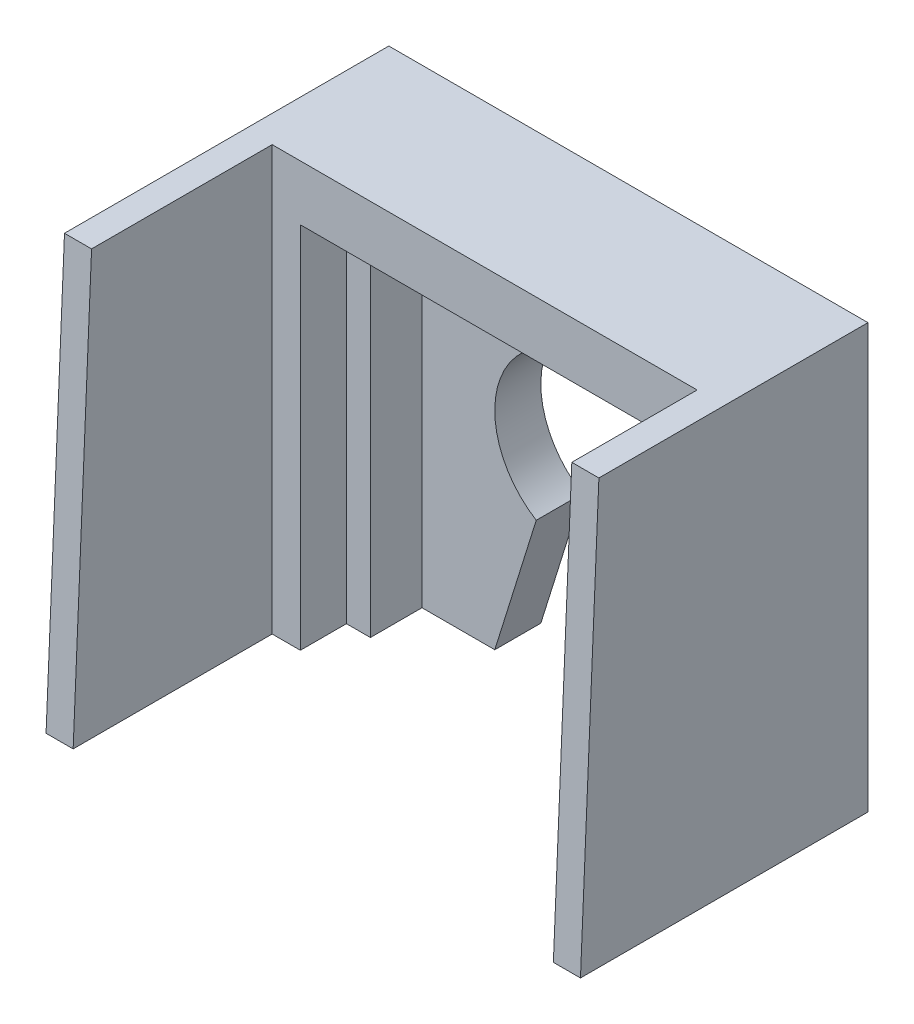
ISO-10303-21;
HEADER;
FILE_DESCRIPTION(('STEP AP214'),'2;1');
FILE_NAME('part.step','',(''),(''),'','','');
FILE_SCHEMA(('AUTOMOTIVE_DESIGN { 1 0 10303 214 1 1 1 1 }'));
ENDSEC;
DATA;
#1=APPLICATION_CONTEXT('core data for automotive mechanical design processes');
#2=APPLICATION_PROTOCOL_DEFINITION('international standard','automotive_design',2000,#1);
#3=PRODUCT_CONTEXT('',#1,'mechanical');
#4=PRODUCT('Part','Part','',(#3));
#5=PRODUCT_RELATED_PRODUCT_CATEGORY('part','',(#4));
#6=PRODUCT_DEFINITION_FORMATION('','',#4);
#7=PRODUCT_DEFINITION_CONTEXT('part definition',#1,'design');
#8=PRODUCT_DEFINITION('design','',#6,#7);
#9=PRODUCT_DEFINITION_SHAPE('','',#8);
#10=(LENGTH_UNIT() NAMED_UNIT(*) SI_UNIT(.MILLI.,.METRE.));
#11=(NAMED_UNIT(*) PLANE_ANGLE_UNIT() SI_UNIT($,.RADIAN.));
#12=(NAMED_UNIT(*) SI_UNIT($,.STERADIAN.) SOLID_ANGLE_UNIT());
#13=UNCERTAINTY_MEASURE_WITH_UNIT(LENGTH_MEASURE(1.E-05),#10,'distance_accuracy_value','');
#14=(GEOMETRIC_REPRESENTATION_CONTEXT(3) GLOBAL_UNCERTAINTY_ASSIGNED_CONTEXT((#13)) GLOBAL_UNIT_ASSIGNED_CONTEXT((#10,
#11,#12)) REPRESENTATION_CONTEXT('',''));
#15=CARTESIAN_POINT('',(0.,0.,0.));
#16=DIRECTION('',(0.,0.,1.));
#17=DIRECTION('',(1.,0.,0.));
#18=AXIS2_PLACEMENT_3D('',#15,#16,#17);
#19=CARTESIAN_POINT('',(13.,-11.25,7.8));
#20=DIRECTION('',(0.,0.,1.));
#21=DIRECTION('',(1.,0.,0.));
#22=AXIS2_PLACEMENT_3D('',#19,#20,#21);
#23=PLANE('',#22);
#24=DIRECTION('',(1.,0.,0.));
#25=VECTOR('',#24,1.);
#26=CARTESIAN_POINT('',(13.,-11.25,7.8));
#27=LINE('',#26,#25);
#28=CARTESIAN_POINT('',(10.,-11.25,7.8));
#29=VERTEX_POINT('',#28);
#30=CARTESIAN_POINT('',(11.53,-11.25,7.8));
#31=VERTEX_POINT('',#30);
#32=EDGE_CURVE('E303',#29,#31,#27,.T.);
#33=ORIENTED_EDGE('',*,*,#32,.T.);
#34=DIRECTION('',(0.,-1.,0.));
#35=VECTOR('',#34,1.);
#36=CARTESIAN_POINT('',(11.53,11.75,7.8));
#37=LINE('',#36,#35);
#38=CARTESIAN_POINT('',(11.53,11.75,7.8));
#39=VERTEX_POINT('',#38);
#40=EDGE_CURVE('E363',#39,#31,#37,.T.);
#41=ORIENTED_EDGE('',*,*,#40,.F.);
#42=DIRECTION('',(-1.,0.,0.));
#43=VECTOR('',#42,1.);
#44=CARTESIAN_POINT('',(-13.,11.75,7.8));
#45=LINE('',#44,#43);
#46=CARTESIAN_POINT('',(-11.53,11.75,7.8));
#47=VERTEX_POINT('',#46);
#48=EDGE_CURVE('E241',#39,#47,#45,.T.);
#49=ORIENTED_EDGE('',*,*,#48,.T.);
#50=DIRECTION('',(0.,1.,0.));
#51=VECTOR('',#50,1.);
#52=CARTESIAN_POINT('',(-11.53,11.75,7.8));
#53=LINE('',#52,#51);
#54=CARTESIAN_POINT('',(-11.53,-11.25,7.8));
#55=VERTEX_POINT('',#54);
#56=EDGE_CURVE('E242',#55,#47,#53,.T.);
#57=ORIENTED_EDGE('',*,*,#56,.F.);
#58=DIRECTION('',(1.,0.,0.));
#59=VECTOR('',#58,1.);
#60=CARTESIAN_POINT('',(-10.,-11.25,7.8));
#61=LINE('',#60,#59);
#62=CARTESIAN_POINT('',(-10.,-11.25,7.8));
#63=VERTEX_POINT('',#62);
#64=EDGE_CURVE('E237',#55,#63,#61,.T.);
#65=ORIENTED_EDGE('',*,*,#64,.T.);
#66=DIRECTION('',(0.,1.,0.));
#67=VECTOR('',#66,1.);
#68=CARTESIAN_POINT('',(-10.,8.75,7.8));
#69=LINE('',#68,#67);
#70=CARTESIAN_POINT('',(-10.,8.75,7.8));
#71=VERTEX_POINT('',#70);
#72=EDGE_CURVE('E240',#63,#71,#69,.T.);
#73=ORIENTED_EDGE('',*,*,#72,.T.);
#74=DIRECTION('',(1.,0.,0.));
#75=VECTOR('',#74,1.);
#76=CARTESIAN_POINT('',(10.,8.75,7.8));
#77=LINE('',#76,#75);
#78=CARTESIAN_POINT('',(10.,8.75,7.8));
#79=VERTEX_POINT('',#78);
#80=EDGE_CURVE('E250',#71,#79,#77,.T.);
#81=ORIENTED_EDGE('',*,*,#80,.T.);
#82=DIRECTION('',(0.,-1.,0.));
#83=VECTOR('',#82,1.);
#84=CARTESIAN_POINT('',(10.,-11.25,7.8));
#85=LINE('',#84,#83);
#86=EDGE_CURVE('E252',#79,#29,#85,.T.);
#87=ORIENTED_EDGE('',*,*,#86,.T.);
#88=EDGE_LOOP('',(#33,#41,#49,#57,#65,#73,#81,#87));
#89=FACE_BOUND('',#88,.T.);
#90=ADVANCED_FACE('F31',(#89),#23,.T.);
#91=CARTESIAN_POINT('',(0.,0.,2.5));
#92=DIRECTION('',(0.,0.,1.));
#93=DIRECTION('',(1.,0.,0.));
#94=AXIS2_PLACEMENT_3D('',#91,#92,#93);
#95=PLANE('',#94);
#96=DIRECTION('',(1.,0.,0.));
#97=VECTOR('',#96,1.);
#98=CARTESIAN_POINT('',(10.,-11.25,2.5));
#99=LINE('',#98,#97);
#100=CARTESIAN_POINT('',(4.75,-11.25,2.5));
#101=VERTEX_POINT('',#100);
#102=CARTESIAN_POINT('',(8.7,-11.25,2.5));
#103=VERTEX_POINT('',#102);
#104=EDGE_CURVE('E221',#101,#103,#99,.T.);
#105=ORIENTED_EDGE('',*,*,#104,.T.);
#106=DIRECTION('',(0.,-1.,0.));
#107=VECTOR('',#106,1.);
#108=CARTESIAN_POINT('',(8.7,8.75,2.5));
#109=LINE('',#108,#107);
#110=CARTESIAN_POINT('',(8.7,8.75,2.5));
#111=VERTEX_POINT('',#110);
#112=EDGE_CURVE('E315',#111,#103,#109,.T.);
#113=ORIENTED_EDGE('',*,*,#112,.F.);
#114=DIRECTION('',(-1.,0.,0.));
#115=VECTOR('',#114,1.);
#116=CARTESIAN_POINT('',(-10.,8.75,2.5));
#117=LINE('',#116,#115);
#118=CARTESIAN_POINT('',(-8.7,8.75,2.5));
#119=VERTEX_POINT('',#118);
#120=EDGE_CURVE('E223',#111,#119,#117,.T.);
#121=ORIENTED_EDGE('',*,*,#120,.T.);
#122=DIRECTION('',(0.,1.,0.));
#123=VECTOR('',#122,1.);
#124=CARTESIAN_POINT('',(-8.7,-11.25,2.5));
#125=LINE('',#124,#123);
#126=CARTESIAN_POINT('',(-8.7,-11.25,2.5));
#127=VERTEX_POINT('',#126);
#128=EDGE_CURVE('E285',#127,#119,#125,.T.);
#129=ORIENTED_EDGE('',*,*,#128,.F.);
#130=DIRECTION('',(1.,0.,0.));
#131=VECTOR('',#130,1.);
#132=CARTESIAN_POINT('',(-10.,-11.25,2.5));
#133=LINE('',#132,#131);
#134=CARTESIAN_POINT('',(-4.75,-11.25,2.5));
#135=VERTEX_POINT('',#134);
#136=EDGE_CURVE('E225',#127,#135,#133,.T.);
#137=ORIENTED_EDGE('',*,*,#136,.T.);
#138=DIRECTION('',(0.297855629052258,0.954610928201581,0.));
#139=VECTOR('',#138,1.);
#140=CARTESIAN_POINT('',(-4.75,-11.25,2.5));
#141=LINE('',#140,#139);
#142=CARTESIAN_POINT('',(-2.5,-4.03887360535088,2.5));
#143=VERTEX_POINT('',#142);
#144=EDGE_CURVE('E227',#135,#143,#141,.T.);
#145=ORIENTED_EDGE('',*,*,#144,.T.);
#146=CARTESIAN_POINT('',(0.,0.,2.5));
#147=DIRECTION('',(0.,0.,-1.));
#148=DIRECTION('',(1.,0.,0.));
#149=AXIS2_PLACEMENT_3D('',#146,#147,#148);
#150=CIRCLE('',#149,4.75);
#151=CARTESIAN_POINT('',(2.5,-4.03887360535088,2.5));
#152=VERTEX_POINT('',#151);
#153=EDGE_CURVE('E216',#143,#152,#150,.T.);
#154=ORIENTED_EDGE('',*,*,#153,.T.);
#155=DIRECTION('',(0.297855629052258,-0.954610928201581,0.));
#156=VECTOR('',#155,1.);
#157=CARTESIAN_POINT('',(4.75,-11.25,2.5));
#158=LINE('',#157,#156);
#159=EDGE_CURVE('E219',#152,#101,#158,.T.);
#160=ORIENTED_EDGE('',*,*,#159,.T.);
#161=EDGE_LOOP('',(#105,#113,#121,#129,#137,#145,#154,#160));
#162=FACE_BOUND('',#161,.T.);
#163=ADVANCED_FACE('F395',(#162),#95,.T.);
#164=CARTESIAN_POINT('',(10.,8.75,7.8));
#165=DIRECTION('',(0.,1.,0.));
#166=DIRECTION('',(0.,0.,1.));
#167=AXIS2_PLACEMENT_3D('',#164,#165,#166);
#168=PLANE('',#167);
#169=DIRECTION('',(0.,0.,-1.));
#170=VECTOR('',#169,1.);
#171=CARTESIAN_POINT('',(8.7,8.75,5.3));
#172=LINE('',#171,#170);
#173=CARTESIAN_POINT('',(8.7,8.75,5.3));
#174=VERTEX_POINT('',#173);
#175=EDGE_CURVE('E288',#174,#111,#172,.T.);
#176=ORIENTED_EDGE('',*,*,#175,.F.);
#177=DIRECTION('',(-1.,0.,0.));
#178=VECTOR('',#177,1.);
#179=CARTESIAN_POINT('',(10.,8.75,5.3));
#180=LINE('',#179,#178);
#181=CARTESIAN_POINT('',(10.,8.75,5.3));
#182=VERTEX_POINT('',#181);
#183=EDGE_CURVE('E329',#182,#174,#180,.T.);
#184=ORIENTED_EDGE('',*,*,#183,.F.);
#185=DIRECTION('',(0.,0.,-1.));
#186=VECTOR('',#185,1.);
#187=CARTESIAN_POINT('',(10.,8.75,7.8));
#188=LINE('',#187,#186);
#189=EDGE_CURVE('E257',#79,#182,#188,.T.);
#190=ORIENTED_EDGE('',*,*,#189,.F.);
#191=ORIENTED_EDGE('',*,*,#80,.F.);
#192=DIRECTION('',(0.,0.,-1.));
#193=VECTOR('',#192,1.);
#194=CARTESIAN_POINT('',(-10.,8.75,7.8));
#195=LINE('',#194,#193);
#196=CARTESIAN_POINT('',(-10.,8.75,5.3));
#197=VERTEX_POINT('',#196);
#198=EDGE_CURVE('E259',#71,#197,#195,.T.);
#199=ORIENTED_EDGE('',*,*,#198,.T.);
#200=DIRECTION('',(-1.,0.,0.));
#201=VECTOR('',#200,1.);
#202=CARTESIAN_POINT('',(-10.,8.75,5.3));
#203=LINE('',#202,#201);
#204=CARTESIAN_POINT('',(-8.7,8.75,5.3));
#205=VERTEX_POINT('',#204);
#206=EDGE_CURVE('E284',#205,#197,#203,.T.);
#207=ORIENTED_EDGE('',*,*,#206,.F.);
#208=DIRECTION('',(0.,0.,-1.));
#209=VECTOR('',#208,1.);
#210=CARTESIAN_POINT('',(-8.7,8.75,5.3));
#211=LINE('',#210,#209);
#212=EDGE_CURVE('E294',#205,#119,#211,.T.);
#213=ORIENTED_EDGE('',*,*,#212,.T.);
#214=ORIENTED_EDGE('',*,*,#120,.F.);
#215=EDGE_LOOP('',(#176,#184,#190,#191,#199,#207,#213,#214));
#216=FACE_BOUND('',#215,.T.);
#217=ADVANCED_FACE('F347',(#216),#168,.F.);
#218=CARTESIAN_POINT('',(10.,-11.25,7.8));
#219=DIRECTION('',(1.,0.,0.));
#220=DIRECTION('',(0.,1.,0.));
#221=AXIS2_PLACEMENT_3D('',#218,#219,#220);
#222=PLANE('',#221);
#223=DIRECTION('',(0.,1.,0.));
#224=VECTOR('',#223,1.);
#225=CARTESIAN_POINT('',(10.,8.75,5.3));
#226=LINE('',#225,#224);
#227=CARTESIAN_POINT('',(10.,-11.25,5.3));
#228=VERTEX_POINT('',#227);
#229=EDGE_CURVE('E320',#228,#182,#226,.T.);
#230=ORIENTED_EDGE('',*,*,#229,.F.);
#231=DIRECTION('',(0.,0.,-1.));
#232=VECTOR('',#231,1.);
#233=CARTESIAN_POINT('',(10.,-11.25,7.8));
#234=LINE('',#233,#232);
#235=EDGE_CURVE('E254',#29,#228,#234,.T.);
#236=ORIENTED_EDGE('',*,*,#235,.F.);
#237=ORIENTED_EDGE('',*,*,#86,.F.);
#238=ORIENTED_EDGE('',*,*,#189,.T.);
#239=EDGE_LOOP('',(#230,#236,#237,#238));
#240=FACE_BOUND('',#239,.T.);
#241=ADVANCED_FACE('F354',(#240),#222,.F.);
#242=CARTESIAN_POINT('',(-10.,8.75,7.8));
#243=DIRECTION('',(-1.,0.,0.));
#244=DIRECTION('',(0.,0.,1.));
#245=AXIS2_PLACEMENT_3D('',#242,#243,#244);
#246=PLANE('',#245);
#247=DIRECTION('',(0.,-1.,0.));
#248=VECTOR('',#247,1.);
#249=CARTESIAN_POINT('',(-10.,-11.25,5.3));
#250=LINE('',#249,#248);
#251=CARTESIAN_POINT('',(-10.,-11.25,5.3));
#252=VERTEX_POINT('',#251);
#253=EDGE_CURVE('E268',#197,#252,#250,.T.);
#254=ORIENTED_EDGE('',*,*,#253,.F.);
#255=ORIENTED_EDGE('',*,*,#198,.F.);
#256=ORIENTED_EDGE('',*,*,#72,.F.);
#257=DIRECTION('',(0.,0.,-1.));
#258=VECTOR('',#257,1.);
#259=CARTESIAN_POINT('',(-10.,-11.25,7.8));
#260=LINE('',#259,#258);
#261=EDGE_CURVE('E199',#63,#252,#260,.T.);
#262=ORIENTED_EDGE('',*,*,#261,.T.);
#263=EDGE_LOOP('',(#254,#255,#256,#262));
#264=FACE_BOUND('',#263,.T.);
#265=ADVANCED_FACE('F265',(#264),#246,.F.);
#266=CARTESIAN_POINT('',(0.,0.,2.5));
#267=DIRECTION('',(0.,0.,-1.));
#268=DIRECTION('',(-1.,0.,0.));
#269=AXIS2_PLACEMENT_3D('',#266,#267,#268);
#270=CYLINDRICAL_SURFACE('',#269,4.75);
#271=CARTESIAN_POINT('',(0.,0.,0.));
#272=DIRECTION('',(0.,0.,-1.));
#273=DIRECTION('',(1.,0.,0.));
#274=AXIS2_PLACEMENT_3D('',#271,#272,#273);
#275=CIRCLE('',#274,4.75);
#276=CARTESIAN_POINT('',(-2.5,-4.03887360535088,0.));
#277=VERTEX_POINT('',#276);
#278=CARTESIAN_POINT('',(2.5,-4.03887360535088,0.));
#279=VERTEX_POINT('',#278);
#280=EDGE_CURVE('E204',#277,#279,#275,.T.);
#281=ORIENTED_EDGE('',*,*,#280,.T.);
#282=DIRECTION('',(0.,0.,-1.));
#283=VECTOR('',#282,1.);
#284=CARTESIAN_POINT('',(2.5,-4.03887360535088,2.5));
#285=LINE('',#284,#283);
#286=EDGE_CURVE('E11',#152,#279,#285,.T.);
#287=ORIENTED_EDGE('',*,*,#286,.F.);
#288=ORIENTED_EDGE('',*,*,#153,.F.);
#289=DIRECTION('',(0.,0.,-1.));
#290=VECTOR('',#289,1.);
#291=CARTESIAN_POINT('',(-2.5,-4.03887360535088,2.5));
#292=LINE('',#291,#290);
#293=EDGE_CURVE('E229',#143,#277,#292,.T.);
#294=ORIENTED_EDGE('',*,*,#293,.T.);
#295=EDGE_LOOP('',(#281,#287,#288,#294));
#296=FACE_BOUND('',#295,.T.);
#297=ADVANCED_FACE('F33',(#296),#270,.F.);
#298=CARTESIAN_POINT('',(4.75,-11.25,2.5));
#299=DIRECTION('',(0.954610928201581,0.297855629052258,0.));
#300=DIRECTION('',(-0.297855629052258,0.954610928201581,0.));
#301=AXIS2_PLACEMENT_3D('',#298,#299,#300);
#302=PLANE('',#301);
#303=DIRECTION('',(0.297855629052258,-0.954610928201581,0.));
#304=VECTOR('',#303,1.);
#305=CARTESIAN_POINT('',(4.75,-11.25,0.));
#306=LINE('',#305,#304);
#307=CARTESIAN_POINT('',(4.75,-11.25,0.));
#308=VERTEX_POINT('',#307);
#309=EDGE_CURVE('E207',#279,#308,#306,.T.);
#310=ORIENTED_EDGE('',*,*,#309,.T.);
#311=DIRECTION('',(0.,0.,-1.));
#312=VECTOR('',#311,1.);
#313=CARTESIAN_POINT('',(4.75,-11.25,2.5));
#314=LINE('',#313,#312);
#315=EDGE_CURVE('E41',#101,#308,#314,.T.);
#316=ORIENTED_EDGE('',*,*,#315,.F.);
#317=ORIENTED_EDGE('',*,*,#159,.F.);
#318=ORIENTED_EDGE('',*,*,#286,.T.);
#319=EDGE_LOOP('',(#310,#316,#317,#318));
#320=FACE_BOUND('',#319,.T.);
#321=ADVANCED_FACE('F427',(#320),#302,.F.);
#322=CARTESIAN_POINT('',(10.,-11.25,2.5));
#323=DIRECTION('',(0.,1.,0.));
#324=DIRECTION('',(0.,0.,1.));
#325=AXIS2_PLACEMENT_3D('',#322,#323,#324);
#326=PLANE('',#325);
#327=DIRECTION('',(0.,0.,-1.));
#328=VECTOR('',#327,1.);
#329=CARTESIAN_POINT('',(13.,-11.25,7.8));
#330=LINE('',#329,#328);
#331=CARTESIAN_POINT('',(13.,-11.25,15.6));
#332=VERTEX_POINT('',#331);
#333=CARTESIAN_POINT('',(13.,-11.25,0.));
#334=VERTEX_POINT('',#333);
#335=EDGE_CURVE('E197',#332,#334,#330,.T.);
#336=ORIENTED_EDGE('',*,*,#335,.F.);
#337=DIRECTION('',(1.,0.,0.));
#338=VECTOR('',#337,1.);
#339=CARTESIAN_POINT('',(-11.8152350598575,-11.25,15.6));
#340=LINE('',#339,#338);
#341=CARTESIAN_POINT('',(11.53,-11.25,15.6));
#342=VERTEX_POINT('',#341);
#343=EDGE_CURVE('E362',#342,#332,#340,.T.);
#344=ORIENTED_EDGE('',*,*,#343,.F.);
#345=DIRECTION('',(0.,0.,-1.));
#346=VECTOR('',#345,1.);
#347=CARTESIAN_POINT('',(11.53,-11.25,18.6));
#348=LINE('',#347,#346);
#349=EDGE_CURVE('E361',#342,#31,#348,.T.);
#350=ORIENTED_EDGE('',*,*,#349,.T.);
#351=ORIENTED_EDGE('',*,*,#32,.F.);
#352=ORIENTED_EDGE('',*,*,#235,.T.);
#353=DIRECTION('',(1.,0.,0.));
#354=VECTOR('',#353,1.);
#355=CARTESIAN_POINT('',(10.,-11.25,5.3));
#356=LINE('',#355,#354);
#357=CARTESIAN_POINT('',(8.7,-11.25,5.3));
#358=VERTEX_POINT('',#357);
#359=EDGE_CURVE('E334',#358,#228,#356,.T.);
#360=ORIENTED_EDGE('',*,*,#359,.F.);
#361=DIRECTION('',(0.,0.,-1.));
#362=VECTOR('',#361,1.);
#363=CARTESIAN_POINT('',(8.7,-11.25,5.3));
#364=LINE('',#363,#362);
#365=EDGE_CURVE('E337',#358,#103,#364,.T.);
#366=ORIENTED_EDGE('',*,*,#365,.T.);
#367=ORIENTED_EDGE('',*,*,#104,.F.);
#368=ORIENTED_EDGE('',*,*,#315,.T.);
#369=DIRECTION('',(1.,0.,0.));
#370=VECTOR('',#369,1.);
#371=CARTESIAN_POINT('',(10.,-11.25,0.));
#372=LINE('',#371,#370);
#373=EDGE_CURVE('E209',#308,#334,#372,.T.);
#374=ORIENTED_EDGE('',*,*,#373,.T.);
#375=EDGE_LOOP('',(#336,#344,#350,#351,#352,#360,#366,#367,#368,#374));
#376=FACE_BOUND('',#375,.T.);
#377=ADVANCED_FACE('F358',(#376),#326,.F.);
#378=CARTESIAN_POINT('',(-10.,-11.25,2.5));
#379=DIRECTION('',(0.,1.,0.));
#380=DIRECTION('',(0.,0.,1.));
#381=AXIS2_PLACEMENT_3D('',#378,#379,#380);
#382=PLANE('',#381);
#383=ORIENTED_EDGE('',*,*,#136,.F.);
#384=DIRECTION('',(0.,0.,-1.));
#385=VECTOR('',#384,1.);
#386=CARTESIAN_POINT('',(-8.7,-11.25,5.3));
#387=LINE('',#386,#385);
#388=CARTESIAN_POINT('',(-8.7,-11.25,5.3));
#389=VERTEX_POINT('',#388);
#390=EDGE_CURVE('E277',#389,#127,#387,.T.);
#391=ORIENTED_EDGE('',*,*,#390,.F.);
#392=DIRECTION('',(1.,0.,0.));
#393=VECTOR('',#392,1.);
#394=CARTESIAN_POINT('',(-10.,-11.25,5.3));
#395=LINE('',#394,#393);
#396=EDGE_CURVE('E273',#252,#389,#395,.T.);
#397=ORIENTED_EDGE('',*,*,#396,.F.);
#398=ORIENTED_EDGE('',*,*,#261,.F.);
#399=ORIENTED_EDGE('',*,*,#64,.F.);
#400=DIRECTION('',(0.,0.,-1.));
#401=VECTOR('',#400,1.);
#402=CARTESIAN_POINT('',(-11.53,-11.25,18.6));
#403=LINE('',#402,#401);
#404=CARTESIAN_POINT('',(-11.53,-11.25,18.6));
#405=VERTEX_POINT('',#404);
#406=EDGE_CURVE('E313',#405,#55,#403,.T.);
#407=ORIENTED_EDGE('',*,*,#406,.F.);
#408=DIRECTION('',(1.,0.,0.));
#409=VECTOR('',#408,1.);
#410=CARTESIAN_POINT('',(-13.,-11.25,18.6));
#411=LINE('',#410,#409);
#412=CARTESIAN_POINT('',(-13.,-11.25,18.6));
#413=VERTEX_POINT('',#412);
#414=EDGE_CURVE('E322',#413,#405,#411,.T.);
#415=ORIENTED_EDGE('',*,*,#414,.F.);
#416=DIRECTION('',(0.,0.,-1.));
#417=VECTOR('',#416,1.);
#418=CARTESIAN_POINT('',(-13.,-11.25,7.8));
#419=LINE('',#418,#417);
#420=CARTESIAN_POINT('',(-13.,-11.25,0.));
#421=VERTEX_POINT('',#420);
#422=EDGE_CURVE('E188',#413,#421,#419,.T.);
#423=ORIENTED_EDGE('',*,*,#422,.T.);
#424=DIRECTION('',(1.,0.,0.));
#425=VECTOR('',#424,1.);
#426=CARTESIAN_POINT('',(-10.,-11.25,0.));
#427=LINE('',#426,#425);
#428=CARTESIAN_POINT('',(-4.75,-11.25,0.));
#429=VERTEX_POINT('',#428);
#430=EDGE_CURVE('E212',#421,#429,#427,.T.);
#431=ORIENTED_EDGE('',*,*,#430,.T.);
#432=DIRECTION('',(0.,0.,-1.));
#433=VECTOR('',#432,1.);
#434=CARTESIAN_POINT('',(-4.75,-11.25,2.5));
#435=LINE('',#434,#433);
#436=EDGE_CURVE('E232',#135,#429,#435,.T.);
#437=ORIENTED_EDGE('',*,*,#436,.F.);
#438=EDGE_LOOP('',(#383,#391,#397,#398,#399,#407,#415,#423,#431,#437));
#439=FACE_BOUND('',#438,.T.);
#440=ADVANCED_FACE('F275',(#439),#382,.F.);
#441=CARTESIAN_POINT('',(-4.75,-11.25,2.5));
#442=DIRECTION('',(-0.954610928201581,0.297855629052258,0.));
#443=DIRECTION('',(-0.297855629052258,-0.954610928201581,0.));
#444=AXIS2_PLACEMENT_3D('',#441,#442,#443);
#445=PLANE('',#444);
#446=DIRECTION('',(0.297855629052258,0.954610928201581,0.));
#447=VECTOR('',#446,1.);
#448=CARTESIAN_POINT('',(-4.75,-11.25,0.));
#449=LINE('',#448,#447);
#450=EDGE_CURVE('E214',#429,#277,#449,.T.);
#451=ORIENTED_EDGE('',*,*,#450,.T.);
#452=ORIENTED_EDGE('',*,*,#293,.F.);
#453=ORIENTED_EDGE('',*,*,#144,.F.);
#454=ORIENTED_EDGE('',*,*,#436,.T.);
#455=EDGE_LOOP('',(#451,#452,#453,#454));
#456=FACE_BOUND('',#455,.T.);
#457=ADVANCED_FACE('F419',(#456),#445,.F.);
#458=CARTESIAN_POINT('',(0.,0.,0.));
#459=DIRECTION('',(0.,0.,1.));
#460=DIRECTION('',(1.,0.,0.));
#461=AXIS2_PLACEMENT_3D('',#458,#459,#460);
#462=PLANE('',#461);
#463=ORIENTED_EDGE('',*,*,#430,.F.);
#464=DIRECTION('',(0.,-1.,0.));
#465=VECTOR('',#464,1.);
#466=CARTESIAN_POINT('',(-13.,-11.25,0.));
#467=LINE('',#466,#465);
#468=CARTESIAN_POINT('',(-13.,11.75,0.));
#469=VERTEX_POINT('',#468);
#470=EDGE_CURVE('E302',#469,#421,#467,.T.);
#471=ORIENTED_EDGE('',*,*,#470,.F.);
#472=DIRECTION('',(-1.,0.,0.));
#473=VECTOR('',#472,1.);
#474=CARTESIAN_POINT('',(-13.,11.75,0.));
#475=LINE('',#474,#473);
#476=CARTESIAN_POINT('',(13.,11.75,0.));
#477=VERTEX_POINT('',#476);
#478=EDGE_CURVE('E193',#477,#469,#475,.T.);
#479=ORIENTED_EDGE('',*,*,#478,.F.);
#480=DIRECTION('',(0.,1.,0.));
#481=VECTOR('',#480,1.);
#482=CARTESIAN_POINT('',(13.,11.75,0.));
#483=LINE('',#482,#481);
#484=EDGE_CURVE('E298',#334,#477,#483,.T.);
#485=ORIENTED_EDGE('',*,*,#484,.F.);
#486=ORIENTED_EDGE('',*,*,#373,.F.);
#487=ORIENTED_EDGE('',*,*,#309,.F.);
#488=ORIENTED_EDGE('',*,*,#280,.F.);
#489=ORIENTED_EDGE('',*,*,#450,.F.);
#490=EDGE_LOOP('',(#463,#471,#479,#485,#486,#487,#488,#489));
#491=FACE_BOUND('',#490,.T.);
#492=ADVANCED_FACE('F381',(#491),#462,.F.);
#493=CARTESIAN_POINT('',(13.,11.75,7.8));
#494=DIRECTION('',(-1.,0.,0.));
#495=DIRECTION('',(0.,-1.,0.));
#496=AXIS2_PLACEMENT_3D('',#493,#494,#495);
#497=PLANE('',#496);
#498=DIRECTION('',(0.,0.,-1.));
#499=VECTOR('',#498,1.);
#500=CARTESIAN_POINT('',(13.,11.75,7.8));
#501=LINE('',#500,#499);
#502=CARTESIAN_POINT('',(13.,11.75,14.6));
#503=VERTEX_POINT('',#502);
#504=EDGE_CURVE('E195',#503,#477,#501,.T.);
#505=ORIENTED_EDGE('',*,*,#504,.F.);
#506=DIRECTION('',(0.,0.99905615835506,-0.043437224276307));
#507=VECTOR('',#506,1.);
#508=CARTESIAN_POINT('',(13.,11.75,14.6));
#509=LINE('',#508,#507);
#510=EDGE_CURVE('E370',#332,#503,#509,.T.);
#511=ORIENTED_EDGE('',*,*,#510,.F.);
#512=ORIENTED_EDGE('',*,*,#335,.T.);
#513=ORIENTED_EDGE('',*,*,#484,.T.);
#514=EDGE_LOOP('',(#505,#511,#512,#513));
#515=FACE_BOUND('',#514,.T.);
#516=ADVANCED_FACE('F377',(#515),#497,.F.);
#517=CARTESIAN_POINT('',(-13.,11.75,7.8));
#518=DIRECTION('',(0.,-1.,0.));
#519=DIRECTION('',(0.,0.,-1.));
#520=AXIS2_PLACEMENT_3D('',#517,#518,#519);
#521=PLANE('',#520);
#522=DIRECTION('',(0.,0.,-1.));
#523=VECTOR('',#522,1.);
#524=CARTESIAN_POINT('',(-13.,11.75,7.8));
#525=LINE('',#524,#523);
#526=CARTESIAN_POINT('',(-13.,11.75,17.6));
#527=VERTEX_POINT('',#526);
#528=EDGE_CURVE('E185',#527,#469,#525,.T.);
#529=ORIENTED_EDGE('',*,*,#528,.F.);
#530=DIRECTION('',(-1.,0.,0.));
#531=VECTOR('',#530,1.);
#532=CARTESIAN_POINT('',(11.4917288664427,11.75,17.6));
#533=LINE('',#532,#531);
#534=CARTESIAN_POINT('',(-11.53,11.75,17.6));
#535=VERTEX_POINT('',#534);
#536=EDGE_CURVE('E171',#535,#527,#533,.T.);
#537=ORIENTED_EDGE('',*,*,#536,.F.);
#538=DIRECTION('',(0.,0.,-1.));
#539=VECTOR('',#538,1.);
#540=CARTESIAN_POINT('',(-11.53,11.75,18.6));
#541=LINE('',#540,#539);
#542=EDGE_CURVE('E35',#535,#47,#541,.T.);
#543=ORIENTED_EDGE('',*,*,#542,.T.);
#544=ORIENTED_EDGE('',*,*,#48,.F.);
#545=DIRECTION('',(0.,0.,-1.));
#546=VECTOR('',#545,1.);
#547=CARTESIAN_POINT('',(11.53,11.75,18.6));
#548=LINE('',#547,#546);
#549=CARTESIAN_POINT('',(11.53,11.75,14.6));
#550=VERTEX_POINT('',#549);
#551=EDGE_CURVE('E56',#550,#39,#548,.T.);
#552=ORIENTED_EDGE('',*,*,#551,.F.);
#553=DIRECTION('',(1.,0.,0.));
#554=VECTOR('',#553,1.);
#555=CARTESIAN_POINT('',(-11.8152350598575,11.75,14.6));
#556=LINE('',#555,#554);
#557=EDGE_CURVE('E49',#550,#503,#556,.T.);
#558=ORIENTED_EDGE('',*,*,#557,.T.);
#559=ORIENTED_EDGE('',*,*,#504,.T.);
#560=ORIENTED_EDGE('',*,*,#478,.T.);
#561=EDGE_LOOP('',(#529,#537,#543,#544,#552,#558,#559,#560));
#562=FACE_BOUND('',#561,.T.);
#563=ADVANCED_FACE('F191',(#562),#521,.F.);
#564=CARTESIAN_POINT('',(-13.,-11.25,7.8));
#565=DIRECTION('',(1.,0.,0.));
#566=DIRECTION('',(0.,0.,-1.));
#567=AXIS2_PLACEMENT_3D('',#564,#565,#566);
#568=PLANE('',#567);
#569=ORIENTED_EDGE('',*,*,#422,.F.);
#570=DIRECTION('',(0.,-0.999056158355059,0.043437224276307));
#571=VECTOR('',#570,1.);
#572=CARTESIAN_POINT('',(-13.,11.75,17.6));
#573=LINE('',#572,#571);
#574=EDGE_CURVE('E174',#527,#413,#573,.T.);
#575=ORIENTED_EDGE('',*,*,#574,.F.);
#576=ORIENTED_EDGE('',*,*,#528,.T.);
#577=ORIENTED_EDGE('',*,*,#470,.T.);
#578=EDGE_LOOP('',(#569,#575,#576,#577));
#579=FACE_BOUND('',#578,.T.);
#580=ADVANCED_FACE('F183',(#579),#568,.F.);
#581=CARTESIAN_POINT('',(-8.7,-11.25,5.3));
#582=DIRECTION('',(-1.,0.,0.));
#583=DIRECTION('',(0.,0.,1.));
#584=AXIS2_PLACEMENT_3D('',#581,#582,#583);
#585=PLANE('',#584);
#586=ORIENTED_EDGE('',*,*,#128,.T.);
#587=ORIENTED_EDGE('',*,*,#212,.F.);
#588=DIRECTION('',(0.,1.,0.));
#589=VECTOR('',#588,1.);
#590=CARTESIAN_POINT('',(-8.7,-11.25,5.3));
#591=LINE('',#590,#589);
#592=EDGE_CURVE('E281',#389,#205,#591,.T.);
#593=ORIENTED_EDGE('',*,*,#592,.F.);
#594=ORIENTED_EDGE('',*,*,#390,.T.);
#595=EDGE_LOOP('',(#586,#587,#593,#594));
#596=FACE_BOUND('',#595,.T.);
#597=ADVANCED_FACE('F404',(#596),#585,.F.);
#598=CARTESIAN_POINT('',(-10.,8.75,5.3));
#599=DIRECTION('',(0.,0.,-1.));
#600=DIRECTION('',(-1.,0.,0.));
#601=AXIS2_PLACEMENT_3D('',#598,#599,#600);
#602=PLANE('',#601);
#603=ORIENTED_EDGE('',*,*,#253,.T.);
#604=ORIENTED_EDGE('',*,*,#396,.T.);
#605=ORIENTED_EDGE('',*,*,#592,.T.);
#606=ORIENTED_EDGE('',*,*,#206,.T.);
#607=EDGE_LOOP('',(#603,#604,#605,#606));
#608=FACE_BOUND('',#607,.T.);
#609=ADVANCED_FACE('F283',(#608),#602,.F.);
#610=CARTESIAN_POINT('',(8.7,8.75,5.3));
#611=DIRECTION('',(1.,0.,0.));
#612=DIRECTION('',(0.,1.,0.));
#613=AXIS2_PLACEMENT_3D('',#610,#611,#612);
#614=PLANE('',#613);
#615=ORIENTED_EDGE('',*,*,#112,.T.);
#616=ORIENTED_EDGE('',*,*,#365,.F.);
#617=DIRECTION('',(0.,-1.,0.));
#618=VECTOR('',#617,1.);
#619=CARTESIAN_POINT('',(8.7,8.75,5.3));
#620=LINE('',#619,#618);
#621=EDGE_CURVE('E332',#174,#358,#620,.T.);
#622=ORIENTED_EDGE('',*,*,#621,.F.);
#623=ORIENTED_EDGE('',*,*,#175,.T.);
#624=EDGE_LOOP('',(#615,#616,#622,#623));
#625=FACE_BOUND('',#624,.T.);
#626=ADVANCED_FACE('F342',(#625),#614,.F.);
#627=CARTESIAN_POINT('',(10.,-11.25,5.3));
#628=DIRECTION('',(0.,0.,-1.));
#629=DIRECTION('',(-1.,0.,0.));
#630=AXIS2_PLACEMENT_3D('',#627,#628,#629);
#631=PLANE('',#630);
#632=ORIENTED_EDGE('',*,*,#229,.T.);
#633=ORIENTED_EDGE('',*,*,#183,.T.);
#634=ORIENTED_EDGE('',*,*,#621,.T.);
#635=ORIENTED_EDGE('',*,*,#359,.T.);
#636=EDGE_LOOP('',(#632,#633,#634,#635));
#637=FACE_BOUND('',#636,.T.);
#638=ADVANCED_FACE('F350',(#637),#631,.F.);
#639=CARTESIAN_POINT('',(-11.53,11.75,18.6));
#640=DIRECTION('',(-1.,0.,0.));
#641=DIRECTION('',(0.,-1.,0.));
#642=AXIS2_PLACEMENT_3D('',#639,#640,#641);
#643=PLANE('',#642);
#644=ORIENTED_EDGE('',*,*,#542,.F.);
#645=DIRECTION('',(0.,0.99905615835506,-0.043437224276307));
#646=VECTOR('',#645,1.);
#647=CARTESIAN_POINT('',(-11.53,11.75,17.6));
#648=LINE('',#647,#646);
#649=EDGE_CURVE('E177',#405,#535,#648,.T.);
#650=ORIENTED_EDGE('',*,*,#649,.F.);
#651=ORIENTED_EDGE('',*,*,#406,.T.);
#652=ORIENTED_EDGE('',*,*,#56,.T.);
#653=EDGE_LOOP('',(#644,#650,#651,#652));
#654=FACE_BOUND('',#653,.T.);
#655=ADVANCED_FACE('F384',(#654),#643,.F.);
#656=CARTESIAN_POINT('',(11.53,11.75,18.6));
#657=DIRECTION('',(1.,0.,0.));
#658=DIRECTION('',(0.,1.,0.));
#659=AXIS2_PLACEMENT_3D('',#656,#657,#658);
#660=PLANE('',#659);
#661=ORIENTED_EDGE('',*,*,#349,.F.);
#662=DIRECTION('',(0.,-0.99905615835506,0.043437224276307));
#663=VECTOR('',#662,1.);
#664=CARTESIAN_POINT('',(11.53,11.75,14.6));
#665=LINE('',#664,#663);
#666=EDGE_CURVE('E365',#550,#342,#665,.T.);
#667=ORIENTED_EDGE('',*,*,#666,.F.);
#668=ORIENTED_EDGE('',*,*,#551,.T.);
#669=ORIENTED_EDGE('',*,*,#40,.T.);
#670=EDGE_LOOP('',(#661,#667,#668,#669));
#671=FACE_BOUND('',#670,.T.);
#672=ADVANCED_FACE('F386',(#671),#660,.F.);
#673=CARTESIAN_POINT('',(-11.8152350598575,11.75,14.6));
#674=DIRECTION('',(0.,-0.043437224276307,-0.99905615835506));
#675=DIRECTION('',(0.,0.99905615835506,-0.043437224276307));
#676=AXIS2_PLACEMENT_3D('',#673,#674,#675);
#677=PLANE('',#676);
#678=ORIENTED_EDGE('',*,*,#666,.T.);
#679=ORIENTED_EDGE('',*,*,#343,.T.);
#680=ORIENTED_EDGE('',*,*,#510,.T.);
#681=ORIENTED_EDGE('',*,*,#557,.F.);
#682=EDGE_LOOP('',(#678,#679,#680,#681));
#683=FACE_BOUND('',#682,.T.);
#684=ADVANCED_FACE('F374',(#683),#677,.F.);
#685=CARTESIAN_POINT('',(11.4917288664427,11.75,17.6));
#686=DIRECTION('',(0.,-0.043437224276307,-0.99905615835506));
#687=DIRECTION('',(0.,0.99905615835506,-0.043437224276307));
#688=AXIS2_PLACEMENT_3D('',#685,#686,#687);
#689=PLANE('',#688);
#690=ORIENTED_EDGE('',*,*,#649,.T.);
#691=ORIENTED_EDGE('',*,*,#536,.T.);
#692=ORIENTED_EDGE('',*,*,#574,.T.);
#693=ORIENTED_EDGE('',*,*,#414,.T.);
#694=EDGE_LOOP('',(#690,#691,#692,#693));
#695=FACE_BOUND('',#694,.T.);
#696=ADVANCED_FACE('F173',(#695),#689,.F.);
#697=CLOSED_SHELL('',(#90,#163,#217,#241,#265,#297,#321,#377,#440,#457,#492,#516,#563,#580,#597,
#609,#626,#638,#655,#672,#684,#696));
#698=MANIFOLD_SOLID_BREP('B2',#697);
#699=ADVANCED_BREP_SHAPE_REPRESENTATION('',(#18,#698),#14);
#700=SHAPE_DEFINITION_REPRESENTATION(#9,#699);
ENDSEC;
END-ISO-10303-21;
